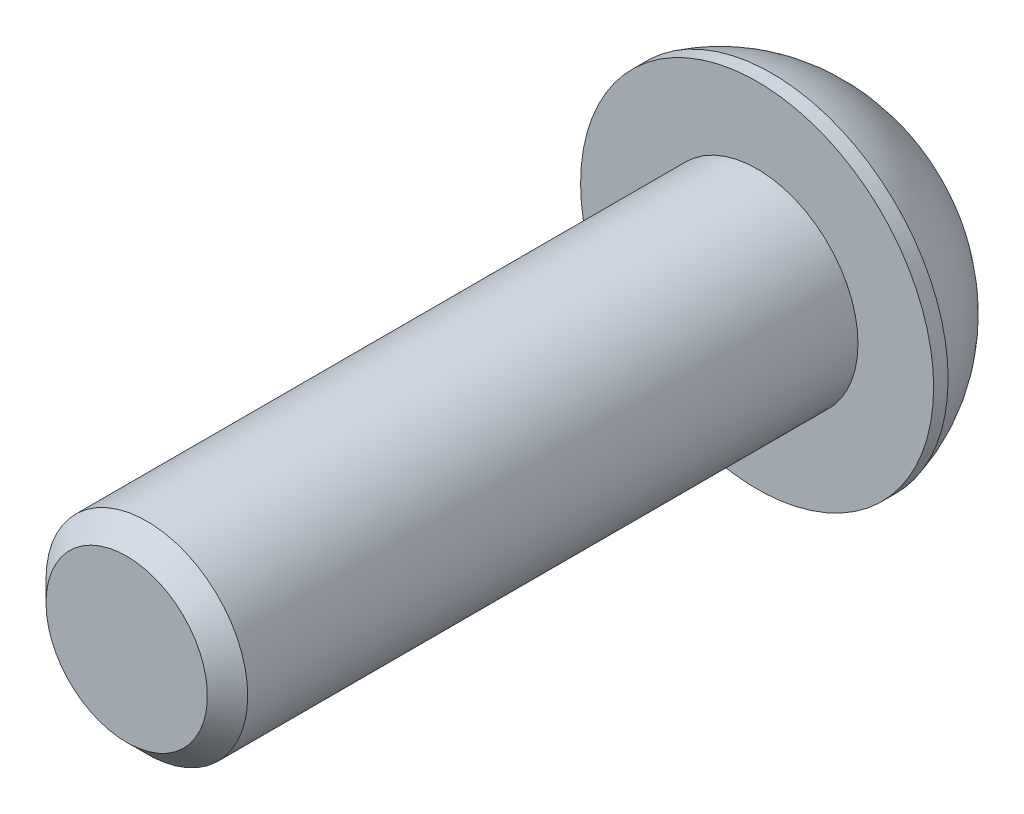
from build123d import *

# Parameters (mm, degrees)
ENLEV_MAT_EXTRU1_DEPTH = 2.6
ESQUISSE3_W            = 4
ESQUISSE3_H            = 25
CHANFREIN1_SIZE        = 0.8


with BuildPart() as part:
    # Esquisse1 → Base-R_volution (revolve)
    with BuildSketch(Plane(origin=(0, 0, 0), x_dir=(1, 0, 0), z_dir=(0, 1, 0)), mode=Mode.PRIVATE) as base_r_volution_sk:
        with BuildLine():
            Line((0, 0), (7, 0))
            Line((7, 0), (7, 0.574933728))
            ThreePointArc((7, 0.574933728), (5.912888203, 2.77937838), (4.064923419, 4.4))
            Line((4.064923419, 4.4), (0, 4.4))
            Line((0, 4.4), (0, 0))
        make_face()
    revolve(base_r_volution_sk.sketch.rotate(Axis((0, 0, 0), (0, 0, -1)), 180), axis=Axis((0, 0, 0), (0, 0, -1)))

    # Esquisse2 → enlev-mat-Extru1 (cut)
    with BuildSketch(Plane.XY.offset(-4.4)):
        Polygon((2.5, -1.443375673), (2.5, 1.443375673), (0, 2.886751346), (-2.5, 1.443375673), (-2.5, -1.443375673), (0, -2.886751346), align=None)
    extrude(amount=ENLEV_MAT_EXTRU1_DEPTH, mode=Mode.SUBTRACT)

    # Esquisse3 → Boss.-R_vol.1 (revolve)
    with BuildSketch(Plane(origin=(0, 0, 0), x_dir=(1, 0, 0), z_dir=(0, 1, 0)), mode=Mode.PRIVATE) as boss_r_vol_1_sk:
        with Locations((2, -12.5)):
            Rectangle(ESQUISSE3_W, ESQUISSE3_H)
    revolve(boss_r_vol_1_sk.sketch.rotate(Axis((0, 0, 0), (0, 0, 1)), 180), axis=Axis((0, 0, 0), (0, 0, 1)))

    # Chanfrein1
    chanfrein1_edges = [part.edges().sort_by_distance(p)[0] for p in [
        (4, 0, 25),
    ]]
    chamfer(chanfrein1_edges, length=CHANFREIN1_SIZE)


solid = part.part
